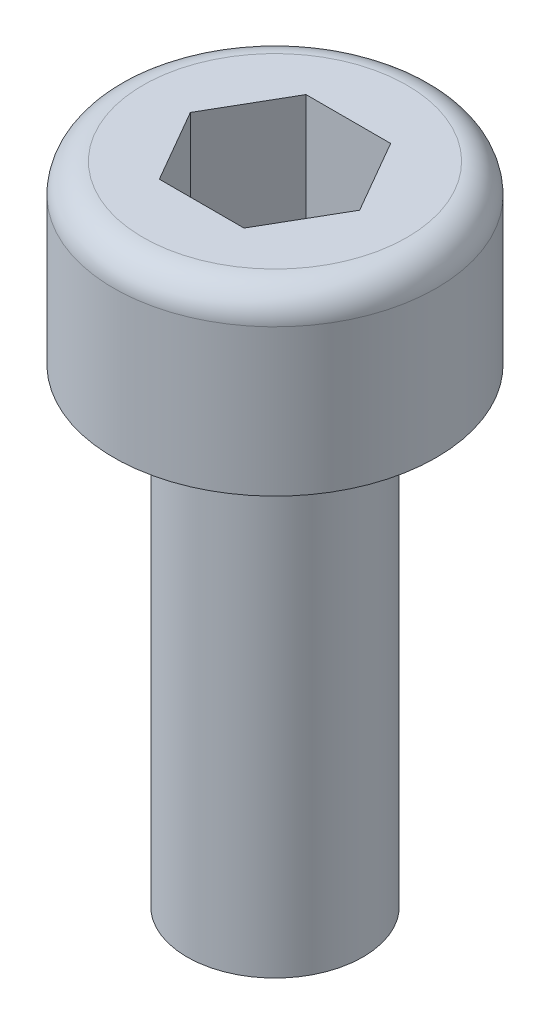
ISO-10303-21;
HEADER;
FILE_DESCRIPTION(('STEP AP214'),'2;1');
FILE_NAME('part.step','',(''),(''),'','','');
FILE_SCHEMA(('AUTOMOTIVE_DESIGN { 1 0 10303 214 1 1 1 1 }'));
ENDSEC;
DATA;
#1=APPLICATION_CONTEXT('core data for automotive mechanical design processes');
#2=APPLICATION_PROTOCOL_DEFINITION('international standard','automotive_design',2000,#1);
#3=PRODUCT_CONTEXT('',#1,'mechanical');
#4=PRODUCT('Part','Part','',(#3));
#5=PRODUCT_RELATED_PRODUCT_CATEGORY('part','',(#4));
#6=PRODUCT_DEFINITION_FORMATION('','',#4);
#7=PRODUCT_DEFINITION_CONTEXT('part definition',#1,'design');
#8=PRODUCT_DEFINITION('design','',#6,#7);
#9=PRODUCT_DEFINITION_SHAPE('','',#8);
#10=(LENGTH_UNIT() NAMED_UNIT(*) SI_UNIT(.MILLI.,.METRE.));
#11=(NAMED_UNIT(*) PLANE_ANGLE_UNIT() SI_UNIT($,.RADIAN.));
#12=(NAMED_UNIT(*) SI_UNIT($,.STERADIAN.) SOLID_ANGLE_UNIT());
#13=UNCERTAINTY_MEASURE_WITH_UNIT(LENGTH_MEASURE(1.E-05),#10,'distance_accuracy_value','');
#14=(GEOMETRIC_REPRESENTATION_CONTEXT(3) GLOBAL_UNCERTAINTY_ASSIGNED_CONTEXT((#13)) GLOBAL_UNIT_ASSIGNED_CONTEXT((#10,
#11,#12)) REPRESENTATION_CONTEXT('',''));
#15=CARTESIAN_POINT('',(0.,0.,0.));
#16=DIRECTION('',(0.,0.,1.));
#17=DIRECTION('',(1.,0.,0.));
#18=AXIS2_PLACEMENT_3D('',#15,#16,#17);
#19=CARTESIAN_POINT('',(0.,2.5,0.));
#20=DIRECTION('',(0.,-1.,0.));
#21=DIRECTION('',(1.,0.,0.));
#22=AXIS2_PLACEMENT_3D('',#19,#20,#21);
#23=TOROIDAL_SURFACE('',#22,2.25,0.5);
#24=CARTESIAN_POINT('',(0.,3.,0.));
#25=DIRECTION('',(0.,-1.,0.));
#26=DIRECTION('',(1.,0.,0.));
#27=AXIS2_PLACEMENT_3D('',#24,#25,#26);
#28=CIRCLE('',#27,2.25);
#29=CARTESIAN_POINT('',(2.25,3.,0.));
#30=VERTEX_POINT('',#29);
#31=EDGE_CURVE('E134',#30,#30,#28,.T.);
#32=ORIENTED_EDGE('',*,*,#31,.T.);
#33=EDGE_LOOP('',(#32));
#34=FACE_BOUND('',#33,.T.);
#35=CARTESIAN_POINT('',(0.,2.5,0.));
#36=DIRECTION('',(0.,-1.,0.));
#37=DIRECTION('',(1.,0.,0.));
#38=AXIS2_PLACEMENT_3D('',#35,#36,#37);
#39=CIRCLE('',#38,2.75);
#40=CARTESIAN_POINT('',(2.75,2.5,0.));
#41=VERTEX_POINT('',#40);
#42=EDGE_CURVE('E11',#41,#41,#39,.T.);
#43=ORIENTED_EDGE('',*,*,#42,.F.);
#44=EDGE_LOOP('',(#43));
#45=FACE_BOUND('',#44,.T.);
#46=ADVANCED_FACE('F31',(#34,#45),#23,.T.);
#47=CARTESIAN_POINT('',(0.,3.,0.));
#48=DIRECTION('',(0.,-1.,0.));
#49=DIRECTION('',(1.,0.,0.));
#50=AXIS2_PLACEMENT_3D('',#47,#48,#49);
#51=CYLINDRICAL_SURFACE('',#50,2.75);
#52=ORIENTED_EDGE('',*,*,#42,.T.);
#53=EDGE_LOOP('',(#52));
#54=FACE_BOUND('',#53,.T.);
#55=CARTESIAN_POINT('',(0.,0.,0.));
#56=DIRECTION('',(0.,-1.,0.));
#57=DIRECTION('',(1.,0.,0.));
#58=AXIS2_PLACEMENT_3D('',#55,#56,#57);
#59=CIRCLE('',#58,2.75);
#60=CARTESIAN_POINT('',(2.75,0.,0.));
#61=VERTEX_POINT('',#60);
#62=EDGE_CURVE('E38',#61,#61,#59,.T.);
#63=ORIENTED_EDGE('',*,*,#62,.F.);
#64=EDGE_LOOP('',(#63));
#65=FACE_BOUND('',#64,.T.);
#66=ADVANCED_FACE('F154',(#54,#65),#51,.T.);
#67=CARTESIAN_POINT('',(2.75,0.,0.));
#68=DIRECTION('',(0.,-1.,0.));
#69=DIRECTION('',(1.,0.,0.));
#70=AXIS2_PLACEMENT_3D('',#67,#68,#69);
#71=PLANE('',#70);
#72=ORIENTED_EDGE('',*,*,#62,.T.);
#73=EDGE_LOOP('',(#72));
#74=FACE_BOUND('',#73,.T.);
#75=CARTESIAN_POINT('',(0.,0.,0.));
#76=DIRECTION('',(0.,-1.,0.));
#77=DIRECTION('',(1.,0.,0.));
#78=AXIS2_PLACEMENT_3D('',#75,#76,#77);
#79=CIRCLE('',#78,1.5);
#80=CARTESIAN_POINT('',(1.5,0.,0.));
#81=VERTEX_POINT('',#80);
#82=EDGE_CURVE('E146',#81,#81,#79,.T.);
#83=ORIENTED_EDGE('',*,*,#82,.F.);
#84=EDGE_LOOP('',(#83));
#85=FACE_BOUND('',#84,.T.);
#86=ADVANCED_FACE('F151',(#74,#85),#71,.T.);
#87=CARTESIAN_POINT('',(0.,3.,0.));
#88=DIRECTION('',(0.,-1.,0.));
#89=DIRECTION('',(1.,0.,0.));
#90=AXIS2_PLACEMENT_3D('',#87,#88,#89);
#91=CYLINDRICAL_SURFACE('',#90,1.5);
#92=ORIENTED_EDGE('',*,*,#82,.T.);
#93=EDGE_LOOP('',(#92));
#94=FACE_BOUND('',#93,.T.);
#95=CARTESIAN_POINT('',(0.,-8.,0.));
#96=DIRECTION('',(0.,-1.,0.));
#97=DIRECTION('',(1.,0.,0.));
#98=AXIS2_PLACEMENT_3D('',#95,#96,#97);
#99=CIRCLE('',#98,1.5);
#100=CARTESIAN_POINT('',(1.5,-8.,0.));
#101=VERTEX_POINT('',#100);
#102=EDGE_CURVE('E143',#101,#101,#99,.T.);
#103=ORIENTED_EDGE('',*,*,#102,.F.);
#104=EDGE_LOOP('',(#103));
#105=FACE_BOUND('',#104,.T.);
#106=ADVANCED_FACE('F161',(#94,#105),#91,.T.);
#107=CARTESIAN_POINT('',(0.,-8.40192378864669,0.));
#108=DIRECTION('',(0.,1.,0.));
#109=DIRECTION('',(-1.,0.,0.));
#110=AXIS2_PLACEMENT_3D('',#107,#108,#109);
#111=CONICAL_SURFACE('',#110,0.,1.30899693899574);
#112=ORIENTED_EDGE('',*,*,#102,.T.);
#113=EDGE_LOOP('',(#112));
#114=FACE_BOUND('',#113,.T.);
#115=CARTESIAN_POINT('',(0.,-8.40192378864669,0.));
#116=VERTEX_POINT('',#115);
#117=VERTEX_LOOP('',#116);
#118=FACE_BOUND('',#117,.T.);
#119=ADVANCED_FACE('F167',(#114,#118),#111,.T.);
#120=CARTESIAN_POINT('',(0.,3.,0.));
#121=DIRECTION('',(0.,1.,0.));
#122=DIRECTION('',(-1.,0.,0.));
#123=AXIS2_PLACEMENT_3D('',#120,#121,#122);
#124=PLANE('',#123);
#125=DIRECTION('',(0.5,0.,-0.866025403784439));
#126=VECTOR('',#125,1.);
#127=CARTESIAN_POINT('',(0.721687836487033,3.,1.25));
#128=LINE('',#127,#126);
#129=CARTESIAN_POINT('',(0.721687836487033,3.,1.25));
#130=VERTEX_POINT('',#129);
#131=CARTESIAN_POINT('',(1.44337567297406,3.,0.));
#132=VERTEX_POINT('',#131);
#133=EDGE_CURVE('E45',#130,#132,#128,.T.);
#134=ORIENTED_EDGE('',*,*,#133,.F.);
#135=DIRECTION('',(1.,0.,0.));
#136=VECTOR('',#135,1.);
#137=CARTESIAN_POINT('',(-0.721687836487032,3.,1.25));
#138=LINE('',#137,#136);
#139=CARTESIAN_POINT('',(-0.721687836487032,3.,1.25));
#140=VERTEX_POINT('',#139);
#141=EDGE_CURVE('E114',#140,#130,#138,.T.);
#142=ORIENTED_EDGE('',*,*,#141,.F.);
#143=DIRECTION('',(0.5,0.,0.866025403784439));
#144=VECTOR('',#143,1.);
#145=CARTESIAN_POINT('',(-1.44337567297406,3.,0.));
#146=LINE('',#145,#144);
#147=CARTESIAN_POINT('',(-1.44337567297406,3.,0.));
#148=VERTEX_POINT('',#147);
#149=EDGE_CURVE('E108',#148,#140,#146,.T.);
#150=ORIENTED_EDGE('',*,*,#149,.F.);
#151=DIRECTION('',(-0.5,0.,0.866025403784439));
#152=VECTOR('',#151,1.);
#153=CARTESIAN_POINT('',(-0.721687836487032,3.,-1.25));
#154=LINE('',#153,#152);
#155=CARTESIAN_POINT('',(-0.721687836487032,3.,-1.25));
#156=VERTEX_POINT('',#155);
#157=EDGE_CURVE('E106',#156,#148,#154,.T.);
#158=ORIENTED_EDGE('',*,*,#157,.F.);
#159=DIRECTION('',(-1.,0.,0.));
#160=VECTOR('',#159,1.);
#161=CARTESIAN_POINT('',(0.721687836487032,3.,-1.25));
#162=LINE('',#161,#160);
#163=CARTESIAN_POINT('',(0.721687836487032,3.,-1.25));
#164=VERTEX_POINT('',#163);
#165=EDGE_CURVE('E87',#164,#156,#162,.T.);
#166=ORIENTED_EDGE('',*,*,#165,.F.);
#167=DIRECTION('',(-0.5,0.,-0.866025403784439));
#168=VECTOR('',#167,1.);
#169=CARTESIAN_POINT('',(1.44337567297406,3.,0.));
#170=LINE('',#169,#168);
#171=EDGE_CURVE('E98',#132,#164,#170,.T.);
#172=ORIENTED_EDGE('',*,*,#171,.F.);
#173=EDGE_LOOP('',(#134,#142,#150,#158,#166,#172));
#174=FACE_BOUND('',#173,.T.);
#175=ORIENTED_EDGE('',*,*,#31,.F.);
#176=EDGE_LOOP('',(#175));
#177=FACE_BOUND('',#176,.T.);
#178=ADVANCED_FACE('F102',(#174,#177),#124,.T.);
#179=CARTESIAN_POINT('',(0.721687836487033,1.,1.25));
#180=DIRECTION('',(0.866025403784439,0.,0.5));
#181=DIRECTION('',(0.5,0.,-0.866025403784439));
#182=AXIS2_PLACEMENT_3D('',#179,#180,#181);
#183=PLANE('',#182);
#184=ORIENTED_EDGE('',*,*,#133,.T.);
#185=DIRECTION('',(0.,1.,0.));
#186=VECTOR('',#185,1.);
#187=CARTESIAN_POINT('',(1.44337567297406,1.,0.));
#188=LINE('',#187,#186);
#189=CARTESIAN_POINT('',(1.44337567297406,1.,0.));
#190=VERTEX_POINT('',#189);
#191=EDGE_CURVE('E95',#190,#132,#188,.T.);
#192=ORIENTED_EDGE('',*,*,#191,.F.);
#193=DIRECTION('',(0.5,0.,-0.866025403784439));
#194=VECTOR('',#193,1.);
#195=CARTESIAN_POINT('',(0.721687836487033,1.,1.25));
#196=LINE('',#195,#194);
#197=CARTESIAN_POINT('',(0.721687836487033,1.,1.25));
#198=VERTEX_POINT('',#197);
#199=EDGE_CURVE('E117',#198,#190,#196,.T.);
#200=ORIENTED_EDGE('',*,*,#199,.F.);
#201=DIRECTION('',(0.,1.,0.));
#202=VECTOR('',#201,1.);
#203=CARTESIAN_POINT('',(0.721687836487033,1.,1.25));
#204=LINE('',#203,#202);
#205=EDGE_CURVE('E132',#198,#130,#204,.T.);
#206=ORIENTED_EDGE('',*,*,#205,.T.);
#207=EDGE_LOOP('',(#184,#192,#200,#206));
#208=FACE_BOUND('',#207,.T.);
#209=ADVANCED_FACE('F174',(#208),#183,.F.);
#210=CARTESIAN_POINT('',(-0.721687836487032,1.,1.25));
#211=DIRECTION('',(0.,0.,1.));
#212=DIRECTION('',(1.,0.,0.));
#213=AXIS2_PLACEMENT_3D('',#210,#211,#212);
#214=PLANE('',#213);
#215=ORIENTED_EDGE('',*,*,#141,.T.);
#216=ORIENTED_EDGE('',*,*,#205,.F.);
#217=DIRECTION('',(1.,0.,0.));
#218=VECTOR('',#217,1.);
#219=CARTESIAN_POINT('',(-0.721687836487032,1.,1.25));
#220=LINE('',#219,#218);
#221=CARTESIAN_POINT('',(-0.721687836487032,1.,1.25));
#222=VERTEX_POINT('',#221);
#223=EDGE_CURVE('E129',#222,#198,#220,.T.);
#224=ORIENTED_EDGE('',*,*,#223,.F.);
#225=DIRECTION('',(0.,1.,0.));
#226=VECTOR('',#225,1.);
#227=CARTESIAN_POINT('',(-0.721687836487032,1.,1.25));
#228=LINE('',#227,#226);
#229=EDGE_CURVE('E135',#222,#140,#228,.T.);
#230=ORIENTED_EDGE('',*,*,#229,.T.);
#231=EDGE_LOOP('',(#215,#216,#224,#230));
#232=FACE_BOUND('',#231,.T.);
#233=ADVANCED_FACE('F177',(#232),#214,.F.);
#234=CARTESIAN_POINT('',(-1.44337567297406,1.,0.));
#235=DIRECTION('',(-0.866025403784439,0.,0.5));
#236=DIRECTION('',(0.5,0.,0.866025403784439));
#237=AXIS2_PLACEMENT_3D('',#234,#235,#236);
#238=PLANE('',#237);
#239=ORIENTED_EDGE('',*,*,#149,.T.);
#240=ORIENTED_EDGE('',*,*,#229,.F.);
#241=DIRECTION('',(0.5,0.,0.866025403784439));
#242=VECTOR('',#241,1.);
#243=CARTESIAN_POINT('',(-1.44337567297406,1.,0.));
#244=LINE('',#243,#242);
#245=CARTESIAN_POINT('',(-1.44337567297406,1.,0.));
#246=VERTEX_POINT('',#245);
#247=EDGE_CURVE('E126',#246,#222,#244,.T.);
#248=ORIENTED_EDGE('',*,*,#247,.F.);
#249=DIRECTION('',(0.,1.,0.));
#250=VECTOR('',#249,1.);
#251=CARTESIAN_POINT('',(-1.44337567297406,1.,0.));
#252=LINE('',#251,#250);
#253=EDGE_CURVE('E137',#246,#148,#252,.T.);
#254=ORIENTED_EDGE('',*,*,#253,.T.);
#255=EDGE_LOOP('',(#239,#240,#248,#254));
#256=FACE_BOUND('',#255,.T.);
#257=ADVANCED_FACE('F186',(#256),#238,.F.);
#258=CARTESIAN_POINT('',(-0.721687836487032,1.,-1.25));
#259=DIRECTION('',(-0.866025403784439,0.,-0.5));
#260=DIRECTION('',(-0.5,0.,0.866025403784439));
#261=AXIS2_PLACEMENT_3D('',#258,#259,#260);
#262=PLANE('',#261);
#263=ORIENTED_EDGE('',*,*,#157,.T.);
#264=ORIENTED_EDGE('',*,*,#253,.F.);
#265=DIRECTION('',(-0.5,0.,0.866025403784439));
#266=VECTOR('',#265,1.);
#267=CARTESIAN_POINT('',(-0.721687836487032,1.,-1.25));
#268=LINE('',#267,#266);
#269=CARTESIAN_POINT('',(-0.721687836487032,1.,-1.25));
#270=VERTEX_POINT('',#269);
#271=EDGE_CURVE('E123',#270,#246,#268,.T.);
#272=ORIENTED_EDGE('',*,*,#271,.F.);
#273=DIRECTION('',(0.,1.,0.));
#274=VECTOR('',#273,1.);
#275=CARTESIAN_POINT('',(-0.721687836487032,1.,-1.25));
#276=LINE('',#275,#274);
#277=EDGE_CURVE('E94',#270,#156,#276,.T.);
#278=ORIENTED_EDGE('',*,*,#277,.T.);
#279=EDGE_LOOP('',(#263,#264,#272,#278));
#280=FACE_BOUND('',#279,.T.);
#281=ADVANCED_FACE('F183',(#280),#262,.F.);
#282=CARTESIAN_POINT('',(0.721687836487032,1.,-1.25));
#283=DIRECTION('',(0.,0.,-1.));
#284=DIRECTION('',(-1.,0.,0.));
#285=AXIS2_PLACEMENT_3D('',#282,#283,#284);
#286=PLANE('',#285);
#287=ORIENTED_EDGE('',*,*,#165,.T.);
#288=ORIENTED_EDGE('',*,*,#277,.F.);
#289=DIRECTION('',(-1.,0.,0.));
#290=VECTOR('',#289,1.);
#291=CARTESIAN_POINT('',(0.721687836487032,1.,-1.25));
#292=LINE('',#291,#290);
#293=CARTESIAN_POINT('',(0.721687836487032,1.,-1.25));
#294=VERTEX_POINT('',#293);
#295=EDGE_CURVE('E90',#294,#270,#292,.T.);
#296=ORIENTED_EDGE('',*,*,#295,.F.);
#297=DIRECTION('',(0.,1.,0.));
#298=VECTOR('',#297,1.);
#299=CARTESIAN_POINT('',(0.721687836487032,1.,-1.25));
#300=LINE('',#299,#298);
#301=EDGE_CURVE('E83',#294,#164,#300,.T.);
#302=ORIENTED_EDGE('',*,*,#301,.T.);
#303=EDGE_LOOP('',(#287,#288,#296,#302));
#304=FACE_BOUND('',#303,.T.);
#305=ADVANCED_FACE('F85',(#304),#286,.F.);
#306=CARTESIAN_POINT('',(1.44337567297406,1.,0.));
#307=DIRECTION('',(0.866025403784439,0.,-0.5));
#308=DIRECTION('',(-0.5,0.,-0.866025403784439));
#309=AXIS2_PLACEMENT_3D('',#306,#307,#308);
#310=PLANE('',#309);
#311=ORIENTED_EDGE('',*,*,#171,.T.);
#312=ORIENTED_EDGE('',*,*,#301,.F.);
#313=DIRECTION('',(-0.5,0.,-0.866025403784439));
#314=VECTOR('',#313,1.);
#315=CARTESIAN_POINT('',(1.44337567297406,1.,0.));
#316=LINE('',#315,#314);
#317=EDGE_CURVE('E120',#190,#294,#316,.T.);
#318=ORIENTED_EDGE('',*,*,#317,.F.);
#319=ORIENTED_EDGE('',*,*,#191,.T.);
#320=EDGE_LOOP('',(#311,#312,#318,#319));
#321=FACE_BOUND('',#320,.T.);
#322=ADVANCED_FACE('F99',(#321),#310,.F.);
#323=CARTESIAN_POINT('',(0.721687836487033,1.,1.25));
#324=DIRECTION('',(0.,-1.,0.));
#325=DIRECTION('',(0.,0.,-1.));
#326=AXIS2_PLACEMENT_3D('',#323,#324,#325);
#327=PLANE('',#326);
#328=ORIENTED_EDGE('',*,*,#199,.T.);
#329=ORIENTED_EDGE('',*,*,#317,.T.);
#330=ORIENTED_EDGE('',*,*,#295,.T.);
#331=ORIENTED_EDGE('',*,*,#271,.T.);
#332=ORIENTED_EDGE('',*,*,#247,.T.);
#333=ORIENTED_EDGE('',*,*,#223,.T.);
#334=EDGE_LOOP('',(#328,#329,#330,#331,#332,#333));
#335=FACE_BOUND('',#334,.T.);
#336=ADVANCED_FACE('F180',(#335),#327,.F.);
#337=CLOSED_SHELL('',(#46,#66,#86,#106,#119,#178,#209,#233,#257,#281,#305,#322,#336));
#338=MANIFOLD_SOLID_BREP('B2',#337);
#339=ADVANCED_BREP_SHAPE_REPRESENTATION('',(#18,#338),#14);
#340=SHAPE_DEFINITION_REPRESENTATION(#9,#339);
ENDSEC;
END-ISO-10303-21;
